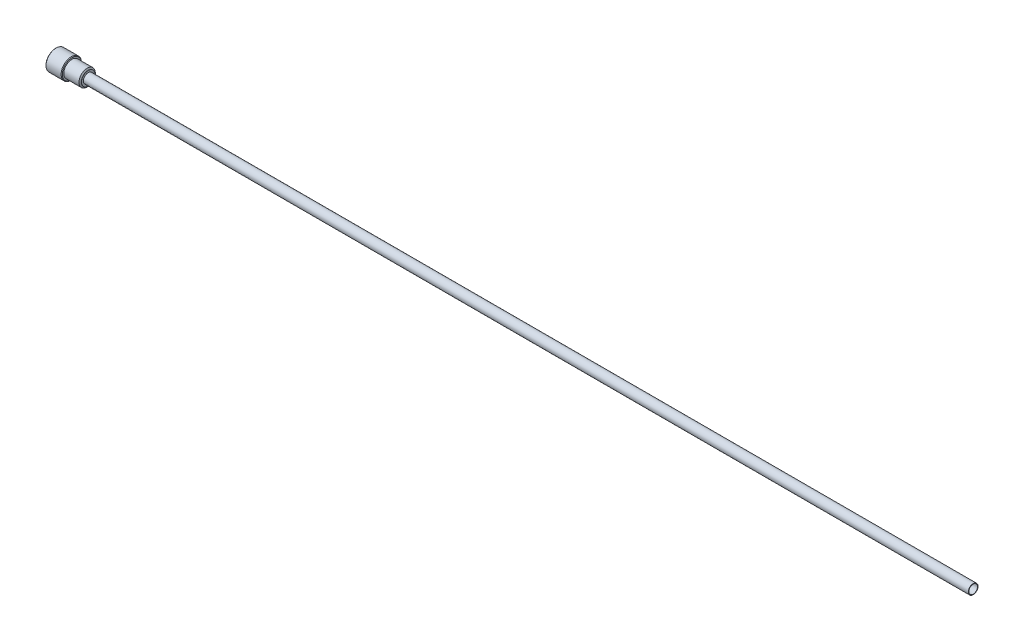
from build123d import *

# Parameters (mm, degrees)
CHAMFER3_SIZE      = 0.3
CHAMFER2_SIZE      = 0.6
CUT_EXTRUDE1_REACH = 452.056


with BuildPart() as part:
    # Sketch1 → Revolve1 (revolve)
    with BuildSketch(Plane.XY, mode=Mode.PRIVATE) as revolve1_sk:
        Polygon((16, 2.3749), (450, 2.3749), (450, 2.1209), (0, 2.1209), (0, 5), (8, 5), (8, 4), (15.49296806, 4), (15.9, 3.295), (16, 3.295), align=None)
    revolve(revolve1_sk.sketch.rotate(Axis((-22.212185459, 0, 0), (1, 0, 0)), 90), axis=Axis((-22.212185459, 0, 0), (1, 0, 0)))

    # Chamfer3
    chamfer3_edges = [part.edges().sort_by_distance(p)[0] for p in [
        (8, 0, -5),
        (0, 0, -5),
    ]]
    chamfer(chamfer3_edges, length=CHAMFER3_SIZE)

    # Sketch6 → Cut-Revolve1 (revolve, cut)
    with BuildSketch(Plane.XY, mode=Mode.PRIVATE) as cut_revolve1_sk:
        Polygon((0, 0), (0, 3), (4.5, 3), (6.302581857, 0), align=None)
    revolve(cut_revolve1_sk.sketch.rotate(Axis((0, 0, 0), (-1, 0, 0)), 270), axis=Axis((0, 0, 0), (-1, 0, 0)), mode=Mode.SUBTRACT)

    # Chamfer2
    chamfer2_edges = [part.edges().sort_by_distance(p)[0] for p in [
        (0, 0, -3),
    ]]
    chamfer(chamfer2_edges, length=CHAMFER2_SIZE)

    # Cut-Extrude1: up to this cone (the profile starts inside it)
    cut_extrude1_end = Plane(origin=(0, 0, 0), z_dir=(-1, 0, 0)).offset(-6.302580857) * Cone(1.664e-06, 781.125979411, 469.347838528, align=(Align.CENTER, Align.CENTER, Align.MIN), mode=Mode.PRIVATE)
    # Sketch7 → Cut-Extrude1 (cut, up to the surface)
    with BuildSketch(Plane.ZY, mode=Mode.PRIVATE) as cut_extrude1_sk1:
        Polygon((-1.732050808, 3), (-3.464101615, 0), (-1.732050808, -3), (1.732050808, -3), (3.464101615, 0), (1.732050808, 3), align=None)
    cut_extrude1_tool1 = extrude(cut_extrude1_sk1.sketch, amount=-CUT_EXTRUDE1_REACH, mode=Mode.PRIVATE) & cut_extrude1_end
    add(cut_extrude1_tool1.solids().sort_by_distance((0, 0, 0))[0], mode=Mode.SUBTRACT)


solid = part.part
